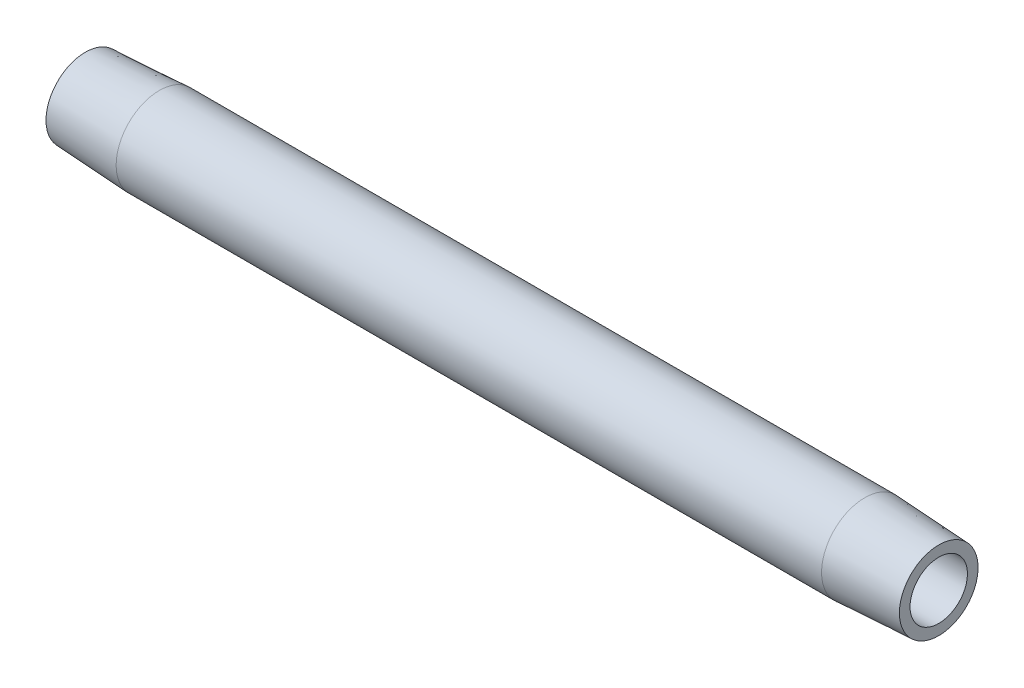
from build123d import *


with BuildPart() as part:
    # Sketch2 → Revolve1 (revolve)
    with BuildSketch(Plane.XY, mode=Mode.PRIVATE) as revolve1_sk:
        Polygon((8.810039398, 5.1435), (0, 4.6817854), (0, 3.4163), (101.6, 3.4163), (101.6, 4.6817854), (92.789960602, 5.1435), align=None)
    revolve(revolve1_sk.sketch.rotate(Axis((0.476141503, 0, 0), (1, 0, 0)), 90), axis=Axis((0.476141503, 0, 0), (1, 0, 0)))


solid = part.part
